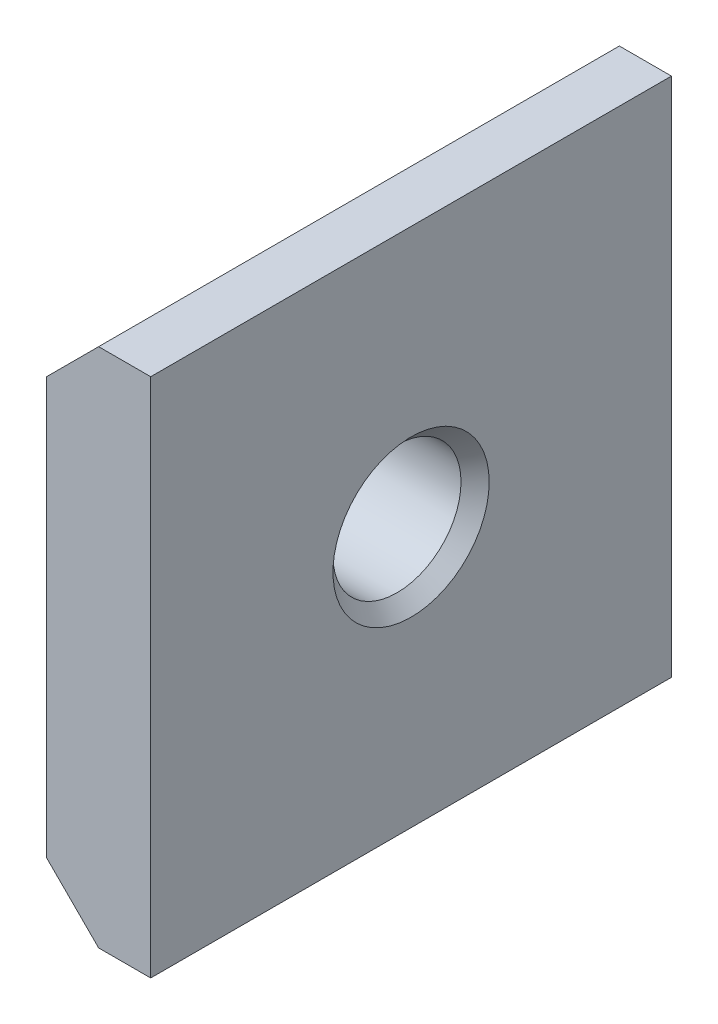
ISO-10303-21;
HEADER;
FILE_DESCRIPTION(('STEP AP214'),'2;1');
FILE_NAME('part.step','',(''),(''),'','','');
FILE_SCHEMA(('AUTOMOTIVE_DESIGN { 1 0 10303 214 1 1 1 1 }'));
ENDSEC;
DATA;
#1=APPLICATION_CONTEXT('core data for automotive mechanical design processes');
#2=APPLICATION_PROTOCOL_DEFINITION('international standard','automotive_design',2000,#1);
#3=PRODUCT_CONTEXT('',#1,'mechanical');
#4=PRODUCT('Part','Part','',(#3));
#5=PRODUCT_RELATED_PRODUCT_CATEGORY('part','',(#4));
#6=PRODUCT_DEFINITION_FORMATION('','',#4);
#7=PRODUCT_DEFINITION_CONTEXT('part definition',#1,'design');
#8=PRODUCT_DEFINITION('design','',#6,#7);
#9=PRODUCT_DEFINITION_SHAPE('','',#8);
#10=(LENGTH_UNIT() NAMED_UNIT(*) SI_UNIT(.MILLI.,.METRE.));
#11=(NAMED_UNIT(*) PLANE_ANGLE_UNIT() SI_UNIT($,.RADIAN.));
#12=(NAMED_UNIT(*) SI_UNIT($,.STERADIAN.) SOLID_ANGLE_UNIT());
#13=UNCERTAINTY_MEASURE_WITH_UNIT(LENGTH_MEASURE(1.E-05),#10,'distance_accuracy_value','');
#14=(GEOMETRIC_REPRESENTATION_CONTEXT(3) GLOBAL_UNCERTAINTY_ASSIGNED_CONTEXT((#13)) GLOBAL_UNIT_ASSIGNED_CONTEXT((#10,
#11,#12)) REPRESENTATION_CONTEXT('',''));
#15=CARTESIAN_POINT('',(0.,0.,0.));
#16=DIRECTION('',(0.,0.,1.));
#17=DIRECTION('',(1.,0.,0.));
#18=AXIS2_PLACEMENT_3D('',#15,#16,#17);
#19=CARTESIAN_POINT('',(-2.70000000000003,0.,0.));
#20=DIRECTION('',(1.,0.,0.));
#21=DIRECTION('',(0.,0.,-1.));
#22=AXIS2_PLACEMENT_3D('',#19,#20,#21);
#23=PLANE('',#22);
#24=CARTESIAN_POINT('',(-2.70000000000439,0.,0.));
#25=DIRECTION('',(-1.,0.,0.));
#26=DIRECTION('',(0.,0.,1.));
#27=AXIS2_PLACEMENT_3D('',#24,#25,#26);
#28=CIRCLE('',#27,1.49999999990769);
#29=CARTESIAN_POINT('',(-2.70000000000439,0.,1.49999999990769));
#30=VERTEX_POINT('',#29);
#31=EDGE_CURVE('E82',#30,#30,#28,.F.);
#32=ORIENTED_EDGE('',*,*,#31,.T.);
#33=EDGE_LOOP('',(#32));
#34=FACE_BOUND('',#33,.T.);
#35=CARTESIAN_POINT('',(-2.70000000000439,0.,0.));
#36=DIRECTION('',(1.,0.,0.));
#37=DIRECTION('',(0.,0.,-1.));
#38=AXIS2_PLACEMENT_3D('',#35,#36,#37);
#39=CIRCLE('',#38,1.99999999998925);
#40=CARTESIAN_POINT('',(-2.70000000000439,0.,-1.99999999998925));
#41=VERTEX_POINT('',#40);
#42=EDGE_CURVE('E19',#41,#41,#39,.T.);
#43=ORIENTED_EDGE('',*,*,#42,.F.);
#44=EDGE_LOOP('',(#43));
#45=FACE_BOUND('',#44,.T.);
#46=ADVANCED_FACE('F16',(#34,#45),#23,.F.);
#47=CARTESIAN_POINT('',(-2.00000000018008,0.,0.));
#48=DIRECTION('',(1.,0.,0.));
#49=DIRECTION('',(0.,0.,-1.));
#50=AXIS2_PLACEMENT_3D('',#47,#48,#49);
#51=CONICAL_SURFACE('',#50,2.14999999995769,0.211093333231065);
#52=ORIENTED_EDGE('',*,*,#42,.T.);
#53=EDGE_LOOP('',(#52));
#54=FACE_BOUND('',#53,.T.);
#55=CARTESIAN_POINT('',(-2.00000000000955,0.,0.));
#56=DIRECTION('',(1.,0.,0.));
#57=DIRECTION('',(0.,0.,-1.));
#58=AXIS2_PLACEMENT_3D('',#55,#56,#57);
#59=CIRCLE('',#58,2.14999999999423);
#60=CARTESIAN_POINT('',(-2.00000000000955,0.,-2.14999999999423));
#61=VERTEX_POINT('',#60);
#62=EDGE_CURVE('E90',#61,#61,#59,.F.);
#63=ORIENTED_EDGE('',*,*,#62,.T.);
#64=EDGE_LOOP('',(#63));
#65=FACE_BOUND('',#64,.T.);
#66=ADVANCED_FACE('F117',(#54,#65),#51,.T.);
#67=CARTESIAN_POINT('',(-2.69999999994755,0.,0.));
#68=DIRECTION('',(-1.,0.,0.));
#69=DIRECTION('',(0.,0.,1.));
#70=AXIS2_PLACEMENT_3D('',#67,#68,#69);
#71=CONICAL_SURFACE('',#70,1.49999999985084,0.785398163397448);
#72=ORIENTED_EDGE('',*,*,#31,.F.);
#73=EDGE_LOOP('',(#72));
#74=FACE_BOUND('',#73,.T.);
#75=CARTESIAN_POINT('',(-2.42950000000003,0.,0.));
#76=DIRECTION('',(-1.,0.,0.));
#77=DIRECTION('',(0.,0.,1.));
#78=AXIS2_PLACEMENT_3D('',#75,#76,#77);
#79=CIRCLE('',#78,1.2295);
#80=CARTESIAN_POINT('',(-2.42950000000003,0.,1.2295));
#81=VERTEX_POINT('',#80);
#82=EDGE_CURVE('E98',#81,#81,#79,.F.);
#83=ORIENTED_EDGE('',*,*,#82,.T.);
#84=EDGE_LOOP('',(#83));
#85=FACE_BOUND('',#84,.T.);
#86=ADVANCED_FACE('F125',(#74,#85),#71,.F.);
#87=CARTESIAN_POINT('',(-2.,-4.00000000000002,5.));
#88=DIRECTION('',(0.70710678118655,0.70710678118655,0.));
#89=DIRECTION('',(-0.70710678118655,0.70710678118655,0.));
#90=AXIS2_PLACEMENT_3D('',#87,#88,#89);
#91=PLANE('',#90);
#92=DIRECTION('',(0.,0.,1.));
#93=VECTOR('',#92,1.);
#94=CARTESIAN_POINT('',(-1.,-5.00000000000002,5.));
#95=LINE('',#94,#93);
#96=CARTESIAN_POINT('',(-1.,-5.00000000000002,-5.));
#97=VERTEX_POINT('',#96);
#98=CARTESIAN_POINT('',(-1.,-5.00000000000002,5.));
#99=VERTEX_POINT('',#98);
#100=EDGE_CURVE('E77',#97,#99,#95,.T.);
#101=ORIENTED_EDGE('',*,*,#100,.T.);
#102=DIRECTION('',(-0.70710678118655,0.70710678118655,0.));
#103=VECTOR('',#102,1.);
#104=CARTESIAN_POINT('',(-2.,-4.00000000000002,5.));
#105=LINE('',#104,#103);
#106=CARTESIAN_POINT('',(-2.,-4.00000000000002,5.));
#107=VERTEX_POINT('',#106);
#108=EDGE_CURVE('E71',#107,#99,#105,.F.);
#109=ORIENTED_EDGE('',*,*,#108,.F.);
#110=DIRECTION('',(0.,0.,-1.));
#111=VECTOR('',#110,1.);
#112=CARTESIAN_POINT('',(-2.,-4.00000000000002,5.));
#113=LINE('',#112,#111);
#114=CARTESIAN_POINT('',(-2.,-4.00000000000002,-5.));
#115=VERTEX_POINT('',#114);
#116=EDGE_CURVE('E74',#107,#115,#113,.T.);
#117=ORIENTED_EDGE('',*,*,#116,.T.);
#118=DIRECTION('',(-0.70710678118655,0.70710678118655,0.));
#119=VECTOR('',#118,1.);
#120=CARTESIAN_POINT('',(-2.,-4.00000000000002,-5.));
#121=LINE('',#120,#119);
#122=EDGE_CURVE('E81',#97,#115,#121,.T.);
#123=ORIENTED_EDGE('',*,*,#122,.F.);
#124=EDGE_LOOP('',(#101,#109,#117,#123));
#125=FACE_BOUND('',#124,.T.);
#126=ADVANCED_FACE('F73',(#125),#91,.F.);
#127=CARTESIAN_POINT('',(-1.,5.00000000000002,5.));
#128=DIRECTION('',(0.70710678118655,-0.70710678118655,0.));
#129=DIRECTION('',(0.70710678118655,0.70710678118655,0.));
#130=AXIS2_PLACEMENT_3D('',#127,#128,#129);
#131=PLANE('',#130);
#132=DIRECTION('',(0.,0.,-1.));
#133=VECTOR('',#132,1.);
#134=CARTESIAN_POINT('',(-2.,4.00000000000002,5.));
#135=LINE('',#134,#133);
#136=CARTESIAN_POINT('',(-2.,4.00000000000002,-5.));
#137=VERTEX_POINT('',#136);
#138=CARTESIAN_POINT('',(-2.,4.00000000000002,5.));
#139=VERTEX_POINT('',#138);
#140=EDGE_CURVE('E65',#137,#139,#135,.F.);
#141=ORIENTED_EDGE('',*,*,#140,.T.);
#142=DIRECTION('',(-0.70710678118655,-0.70710678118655,0.));
#143=VECTOR('',#142,1.);
#144=CARTESIAN_POINT('',(-1.,5.00000000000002,5.));
#145=LINE('',#144,#143);
#146=CARTESIAN_POINT('',(-1.,5.00000000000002,5.));
#147=VERTEX_POINT('',#146);
#148=EDGE_CURVE('E94',#147,#139,#145,.T.);
#149=ORIENTED_EDGE('',*,*,#148,.F.);
#150=DIRECTION('',(0.,0.,-1.));
#151=VECTOR('',#150,1.);
#152=CARTESIAN_POINT('',(-1.,5.00000000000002,5.));
#153=LINE('',#152,#151);
#154=CARTESIAN_POINT('',(-1.,5.00000000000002,-5.));
#155=VERTEX_POINT('',#154);
#156=EDGE_CURVE('E188',#147,#155,#153,.T.);
#157=ORIENTED_EDGE('',*,*,#156,.T.);
#158=DIRECTION('',(0.70710678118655,0.70710678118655,0.));
#159=VECTOR('',#158,1.);
#160=CARTESIAN_POINT('',(-1.,5.00000000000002,-5.));
#161=LINE('',#160,#159);
#162=EDGE_CURVE('E107',#137,#155,#161,.T.);
#163=ORIENTED_EDGE('',*,*,#162,.F.);
#164=EDGE_LOOP('',(#141,#149,#157,#163));
#165=FACE_BOUND('',#164,.T.);
#166=ADVANCED_FACE('F158',(#165),#131,.F.);
#167=CARTESIAN_POINT('',(-2.,4.00000000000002,5.));
#168=DIRECTION('',(1.,0.,0.));
#169=DIRECTION('',(0.,0.,-1.));
#170=AXIS2_PLACEMENT_3D('',#167,#168,#169);
#171=PLANE('',#170);
#172=ORIENTED_EDGE('',*,*,#62,.F.);
#173=EDGE_LOOP('',(#172));
#174=FACE_BOUND('',#173,.T.);
#175=ORIENTED_EDGE('',*,*,#116,.F.);
#176=DIRECTION('',(0.,1.,0.));
#177=VECTOR('',#176,1.);
#178=CARTESIAN_POINT('',(-2.,0.,5.));
#179=LINE('',#178,#177);
#180=EDGE_CURVE('E87',#139,#107,#179,.F.);
#181=ORIENTED_EDGE('',*,*,#180,.F.);
#182=ORIENTED_EDGE('',*,*,#140,.F.);
#183=DIRECTION('',(0.,1.,0.));
#184=VECTOR('',#183,1.);
#185=CARTESIAN_POINT('',(-2.,0.,-5.));
#186=LINE('',#185,#184);
#187=EDGE_CURVE('E89',#137,#115,#186,.F.);
#188=ORIENTED_EDGE('',*,*,#187,.T.);
#189=EDGE_LOOP('',(#175,#181,#182,#188));
#190=FACE_BOUND('',#189,.T.);
#191=ADVANCED_FACE('F86',(#174,#190),#171,.F.);
#192=CARTESIAN_POINT('',(0.,0.,0.));
#193=DIRECTION('',(-1.,0.,0.));
#194=DIRECTION('',(0.,0.,1.));
#195=AXIS2_PLACEMENT_3D('',#192,#193,#194);
#196=CYLINDRICAL_SURFACE('',#195,1.2295);
#197=ORIENTED_EDGE('',*,*,#82,.F.);
#198=EDGE_LOOP('',(#197));
#199=FACE_BOUND('',#198,.T.);
#200=CARTESIAN_POINT('',(-0.270500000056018,0.,0.));
#201=DIRECTION('',(1.,0.,0.));
#202=DIRECTION('',(0.,0.,-1.));
#203=AXIS2_PLACEMENT_3D('',#200,#201,#202);
#204=CIRCLE('',#203,1.2295000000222);
#205=CARTESIAN_POINT('',(-0.270500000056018,0.,-1.2295000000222));
#206=VERTEX_POINT('',#205);
#207=EDGE_CURVE('E173',#206,#206,#204,.T.);
#208=ORIENTED_EDGE('',*,*,#207,.T.);
#209=EDGE_LOOP('',(#208));
#210=FACE_BOUND('',#209,.T.);
#211=ADVANCED_FACE('F151',(#199,#210),#196,.F.);
#212=CARTESIAN_POINT('',(-1.,-5.00000000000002,5.));
#213=DIRECTION('',(0.,1.,0.));
#214=DIRECTION('',(0.,0.,1.));
#215=AXIS2_PLACEMENT_3D('',#212,#213,#214);
#216=PLANE('',#215);
#217=DIRECTION('',(0.,0.,1.));
#218=VECTOR('',#217,1.);
#219=CARTESIAN_POINT('',(0.,-5.00000000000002,5.));
#220=LINE('',#219,#218);
#221=CARTESIAN_POINT('',(0.,-5.00000000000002,-5.));
#222=VERTEX_POINT('',#221);
#223=CARTESIAN_POINT('',(0.,-5.00000000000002,5.));
#224=VERTEX_POINT('',#223);
#225=EDGE_CURVE('E174',#222,#224,#220,.T.);
#226=ORIENTED_EDGE('',*,*,#225,.T.);
#227=DIRECTION('',(1.,0.,0.));
#228=VECTOR('',#227,1.);
#229=CARTESIAN_POINT('',(0.,-5.00000000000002,5.));
#230=LINE('',#229,#228);
#231=EDGE_CURVE('E95',#99,#224,#230,.T.);
#232=ORIENTED_EDGE('',*,*,#231,.F.);
#233=ORIENTED_EDGE('',*,*,#100,.F.);
#234=DIRECTION('',(1.,0.,0.));
#235=VECTOR('',#234,1.);
#236=CARTESIAN_POINT('',(0.,-5.00000000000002,-5.));
#237=LINE('',#236,#235);
#238=EDGE_CURVE('E185',#97,#222,#237,.T.);
#239=ORIENTED_EDGE('',*,*,#238,.T.);
#240=EDGE_LOOP('',(#226,#232,#233,#239));
#241=FACE_BOUND('',#240,.T.);
#242=ADVANCED_FACE('F148',(#241),#216,.F.);
#243=CARTESIAN_POINT('',(0.,0.,5.));
#244=DIRECTION('',(0.,0.,1.));
#245=DIRECTION('',(1.,0.,0.));
#246=AXIS2_PLACEMENT_3D('',#243,#244,#245);
#247=PLANE('',#246);
#248=DIRECTION('',(1.,0.,0.));
#249=VECTOR('',#248,1.);
#250=CARTESIAN_POINT('',(0.,5.00000000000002,5.));
#251=LINE('',#250,#249);
#252=CARTESIAN_POINT('',(0.,5.00000000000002,5.));
#253=VERTEX_POINT('',#252);
#254=EDGE_CURVE('E191',#253,#147,#251,.F.);
#255=ORIENTED_EDGE('',*,*,#254,.T.);
#256=ORIENTED_EDGE('',*,*,#148,.T.);
#257=ORIENTED_EDGE('',*,*,#180,.T.);
#258=ORIENTED_EDGE('',*,*,#108,.T.);
#259=ORIENTED_EDGE('',*,*,#231,.T.);
#260=DIRECTION('',(0.,1.,0.));
#261=VECTOR('',#260,1.);
#262=CARTESIAN_POINT('',(0.,-5.00000000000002,5.));
#263=LINE('',#262,#261);
#264=EDGE_CURVE('E177',#224,#253,#263,.T.);
#265=ORIENTED_EDGE('',*,*,#264,.T.);
#266=EDGE_LOOP('',(#255,#256,#257,#258,#259,#265));
#267=FACE_BOUND('',#266,.T.);
#268=ADVANCED_FACE('F93',(#267),#247,.T.);
#269=CARTESIAN_POINT('',(0.,5.00000000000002,5.));
#270=DIRECTION('',(0.,-1.,0.));
#271=DIRECTION('',(0.,0.,-1.));
#272=AXIS2_PLACEMENT_3D('',#269,#270,#271);
#273=PLANE('',#272);
#274=ORIENTED_EDGE('',*,*,#156,.F.);
#275=ORIENTED_EDGE('',*,*,#254,.F.);
#276=DIRECTION('',(0.,0.,1.));
#277=VECTOR('',#276,1.);
#278=CARTESIAN_POINT('',(0.,5.00000000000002,5.));
#279=LINE('',#278,#277);
#280=CARTESIAN_POINT('',(0.,5.00000000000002,-5.));
#281=VERTEX_POINT('',#280);
#282=EDGE_CURVE('E197',#253,#281,#279,.F.);
#283=ORIENTED_EDGE('',*,*,#282,.T.);
#284=DIRECTION('',(1.,0.,0.));
#285=VECTOR('',#284,1.);
#286=CARTESIAN_POINT('',(0.,5.00000000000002,-5.));
#287=LINE('',#286,#285);
#288=EDGE_CURVE('E34',#281,#155,#287,.F.);
#289=ORIENTED_EDGE('',*,*,#288,.T.);
#290=EDGE_LOOP('',(#274,#275,#283,#289));
#291=FACE_BOUND('',#290,.T.);
#292=ADVANCED_FACE('F142',(#291),#273,.F.);
#293=CARTESIAN_POINT('',(0.,0.,-5.));
#294=DIRECTION('',(0.,0.,1.));
#295=DIRECTION('',(1.,0.,0.));
#296=AXIS2_PLACEMENT_3D('',#293,#294,#295);
#297=PLANE('',#296);
#298=ORIENTED_EDGE('',*,*,#162,.T.);
#299=ORIENTED_EDGE('',*,*,#288,.F.);
#300=DIRECTION('',(0.,1.,0.));
#301=VECTOR('',#300,1.);
#302=CARTESIAN_POINT('',(0.,-5.00000000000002,-5.));
#303=LINE('',#302,#301);
#304=EDGE_CURVE('E25',#281,#222,#303,.F.);
#305=ORIENTED_EDGE('',*,*,#304,.T.);
#306=ORIENTED_EDGE('',*,*,#238,.F.);
#307=ORIENTED_EDGE('',*,*,#122,.T.);
#308=ORIENTED_EDGE('',*,*,#187,.F.);
#309=EDGE_LOOP('',(#298,#299,#305,#306,#307,#308));
#310=FACE_BOUND('',#309,.T.);
#311=ADVANCED_FACE('F134',(#310),#297,.F.);
#312=CARTESIAN_POINT('',(-1.13686837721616E-10,0.,0.));
#313=DIRECTION('',(1.,0.,0.));
#314=DIRECTION('',(0.,0.,-1.));
#315=AXIS2_PLACEMENT_3D('',#312,#313,#314);
#316=CONICAL_SURFACE('',#315,1.49999999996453,0.785398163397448);
#317=ORIENTED_EDGE('',*,*,#207,.F.);
#318=EDGE_LOOP('',(#317));
#319=FACE_BOUND('',#318,.T.);
#320=CARTESIAN_POINT('',(-5.6843418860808E-11,0.,0.));
#321=DIRECTION('',(1.,0.,0.));
#322=DIRECTION('',(0.,0.,-1.));
#323=AXIS2_PLACEMENT_3D('',#320,#321,#322);
#324=CIRCLE('',#323,1.50000000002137);
#325=CARTESIAN_POINT('',(-5.6843418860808E-11,0.,-1.50000000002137));
#326=VERTEX_POINT('',#325);
#327=EDGE_CURVE('E11',#326,#326,#324,.T.);
#328=ORIENTED_EDGE('',*,*,#327,.T.);
#329=EDGE_LOOP('',(#328));
#330=FACE_BOUND('',#329,.T.);
#331=ADVANCED_FACE('F128',(#319,#330),#316,.F.);
#332=CARTESIAN_POINT('',(0.,-5.00000000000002,5.));
#333=DIRECTION('',(-1.,0.,0.));
#334=DIRECTION('',(0.,0.,1.));
#335=AXIS2_PLACEMENT_3D('',#332,#333,#334);
#336=PLANE('',#335);
#337=ORIENTED_EDGE('',*,*,#327,.F.);
#338=EDGE_LOOP('',(#337));
#339=FACE_BOUND('',#338,.T.);
#340=ORIENTED_EDGE('',*,*,#282,.F.);
#341=ORIENTED_EDGE('',*,*,#264,.F.);
#342=ORIENTED_EDGE('',*,*,#225,.F.);
#343=ORIENTED_EDGE('',*,*,#304,.F.);
#344=EDGE_LOOP('',(#340,#341,#342,#343));
#345=FACE_BOUND('',#344,.T.);
#346=ADVANCED_FACE('F126',(#339,#345),#336,.F.);
#347=CLOSED_SHELL('',(#46,#66,#86,#126,#166,#191,#211,#242,#268,#292,#311,#331,#346));
#348=MANIFOLD_SOLID_BREP('B1',#347);
#349=ADVANCED_BREP_SHAPE_REPRESENTATION('',(#18,#348),#14);
#350=SHAPE_DEFINITION_REPRESENTATION(#9,#349);
ENDSEC;
END-ISO-10303-21;
